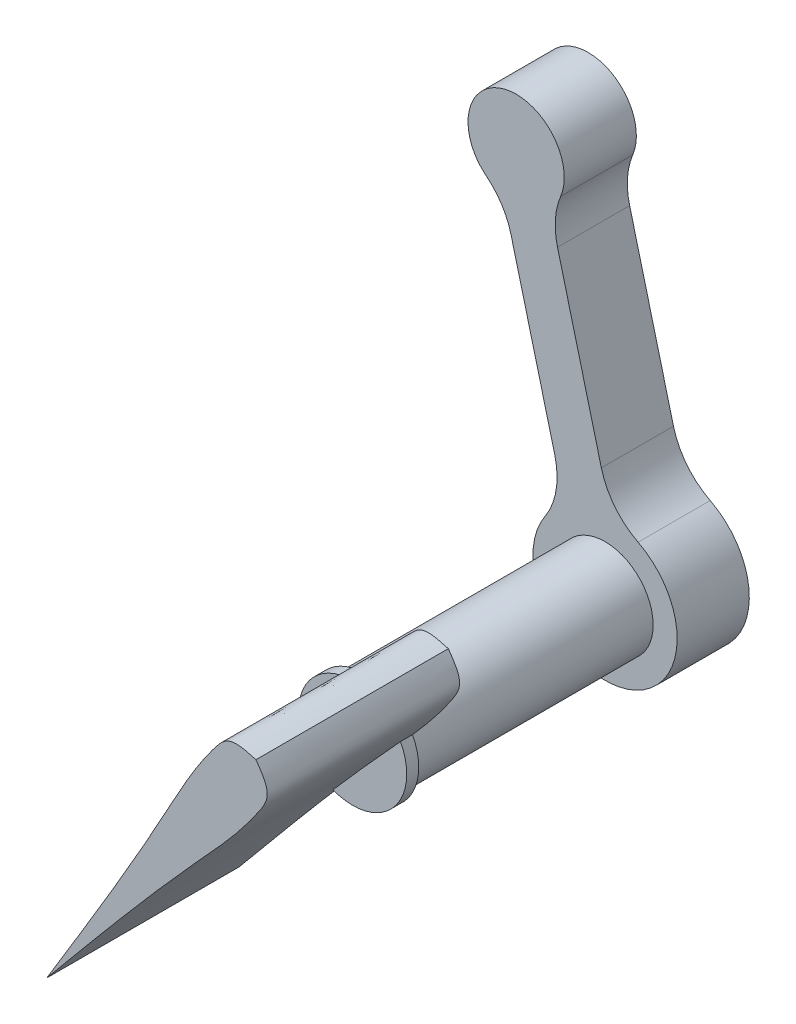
ISO-10303-21;
HEADER;
FILE_DESCRIPTION(('STEP AP214'),'2;1');
FILE_NAME('part.step','',(''),(''),'','','');
FILE_SCHEMA(('AUTOMOTIVE_DESIGN { 1 0 10303 214 1 1 1 1 }'));
ENDSEC;
DATA;
#1=APPLICATION_CONTEXT('core data for automotive mechanical design processes');
#2=APPLICATION_PROTOCOL_DEFINITION('international standard','automotive_design',2000,#1);
#3=PRODUCT_CONTEXT('',#1,'mechanical');
#4=PRODUCT('Part','Part','',(#3));
#5=PRODUCT_RELATED_PRODUCT_CATEGORY('part','',(#4));
#6=PRODUCT_DEFINITION_FORMATION('','',#4);
#7=PRODUCT_DEFINITION_CONTEXT('part definition',#1,'design');
#8=PRODUCT_DEFINITION('design','',#6,#7);
#9=PRODUCT_DEFINITION_SHAPE('','',#8);
#10=(LENGTH_UNIT() NAMED_UNIT(*) SI_UNIT(.MILLI.,.METRE.));
#11=(NAMED_UNIT(*) PLANE_ANGLE_UNIT() SI_UNIT($,.RADIAN.));
#12=(NAMED_UNIT(*) SI_UNIT($,.STERADIAN.) SOLID_ANGLE_UNIT());
#13=UNCERTAINTY_MEASURE_WITH_UNIT(LENGTH_MEASURE(1.E-05),#10,'distance_accuracy_value','');
#14=(GEOMETRIC_REPRESENTATION_CONTEXT(3) GLOBAL_UNCERTAINTY_ASSIGNED_CONTEXT((#13)) GLOBAL_UNIT_ASSIGNED_CONTEXT((#10,
#11,#12)) REPRESENTATION_CONTEXT('',''));
#15=CARTESIAN_POINT('',(0.,0.,0.));
#16=DIRECTION('',(0.,0.,1.));
#17=DIRECTION('',(1.,0.,0.));
#18=AXIS2_PLACEMENT_3D('',#15,#16,#17);
#19=CARTESIAN_POINT('',(-4.96243774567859,31.4097749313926,0.));
#20=DIRECTION('',(0.,0.,1.));
#21=DIRECTION('',(1.,0.,0.));
#22=AXIS2_PLACEMENT_3D('',#19,#20,#21);
#23=PLANE('',#22);
#24=CARTESIAN_POINT('',(-4.96243774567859,31.4097749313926,0.));
#25=DIRECTION('',(0.,0.,-1.));
#26=DIRECTION('',(1.,0.,0.));
#27=AXIS2_PLACEMENT_3D('',#24,#25,#26);
#28=CIRCLE('',#27,3.);
#29=CARTESIAN_POINT('',(-2.05836560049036,32.1623471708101,0.));
#30=VERTEX_POINT('',#29);
#31=CARTESIAN_POINT('',(-2.46545542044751,29.7469221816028,0.));
#32=VERTEX_POINT('',#31);
#33=EDGE_CURVE('E617',#30,#32,#28,.T.);
#34=ORIENTED_EDGE('',*,*,#33,.T.);
#35=CARTESIAN_POINT('',(0.0315269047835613,28.0840694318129,0.));
#36=DIRECTION('',(0.,0.,1.));
#37=DIRECTION('',(1.,0.,0.));
#38=AXIS2_PLACEMENT_3D('',#35,#36,#37);
#39=CIRCLE('',#38,3.);
#40=CARTESIAN_POINT('',(1.40664077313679,30.7503518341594,0.));
#41=VERTEX_POINT('',#40);
#42=EDGE_CURVE('E614',#32,#41,#39,.T.);
#43=ORIENTED_EDGE('',*,*,#42,.T.);
#44=CARTESIAN_POINT('',(2.78175464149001,33.4166342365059,0.));
#45=DIRECTION('',(0.,0.,-1.));
#46=DIRECTION('',(-1.,0.,0.));
#47=AXIS2_PLACEMENT_3D('',#44,#45,#46);
#48=CIRCLE('',#47,3.);
#49=CARTESIAN_POINT('',(-0.122317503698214,32.6640619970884,0.));
#50=VERTEX_POINT('',#49);
#51=EDGE_CURVE('E611',#41,#50,#48,.T.);
#52=ORIENTED_EDGE('',*,*,#51,.T.);
#53=DIRECTION('',(-0.250857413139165,0.968024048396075,0.));
#54=VECTOR('',#53,1.);
#55=CARTESIAN_POINT('',(-1.94552307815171,39.6995600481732,0.));
#56=LINE('',#55,#54);
#57=CARTESIAN_POINT('',(-1.94552307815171,39.6995600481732,0.));
#58=VERTEX_POINT('',#57);
#59=EDGE_CURVE('E608',#50,#58,#56,.T.);
#60=ORIENTED_EDGE('',*,*,#59,.T.);
#61=CARTESIAN_POINT('',(0.958549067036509,40.4521322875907,0.));
#62=DIRECTION('',(0.,0.,-1.));
#63=DIRECTION('',(-1.,0.,0.));
#64=AXIS2_PLACEMENT_3D('',#61,#62,#63);
#65=CIRCLE('',#64,3.);
#66=CARTESIAN_POINT('',(-1.81625199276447,41.5925177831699,0.));
#67=VERTEX_POINT('',#66);
#68=EDGE_CURVE('E605',#58,#67,#65,.T.);
#69=ORIENTED_EDGE('',*,*,#68,.T.);
#70=CARTESIAN_POINT('',(-3.66611936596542,42.3527747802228,0.));
#71=DIRECTION('',(0.,0.,1.));
#72=DIRECTION('',(1.,0.,0.));
#73=AXIS2_PLACEMENT_3D('',#70,#71,#72);
#74=CIRCLE('',#73,2.00000000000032);
#75=CARTESIAN_POINT('',(-4.91392894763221,40.7897740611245,0.));
#76=VERTEX_POINT('',#75);
#77=EDGE_CURVE('E602',#67,#76,#74,.T.);
#78=ORIENTED_EDGE('',*,*,#77,.T.);
#79=CARTESIAN_POINT('',(-6.78564332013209,38.4452729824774,0.));
#80=DIRECTION('',(0.,0.,-1.));
#81=DIRECTION('',(1.,0.,0.));
#82=AXIS2_PLACEMENT_3D('',#79,#80,#81);
#83=CIRCLE('',#82,3.);
#84=CARTESIAN_POINT('',(-3.88157117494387,39.1978452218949,0.));
#85=VERTEX_POINT('',#84);
#86=EDGE_CURVE('E599',#76,#85,#83,.T.);
#87=ORIENTED_EDGE('',*,*,#86,.T.);
#88=DIRECTION('',(0.250857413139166,-0.968024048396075,0.));
#89=VECTOR('',#88,1.);
#90=CARTESIAN_POINT('',(-3.88157117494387,39.1978452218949,0.));
#91=LINE('',#90,#89);
#92=EDGE_CURVE('E582',#85,#30,#91,.T.);
#93=ORIENTED_EDGE('',*,*,#92,.T.);
#94=EDGE_LOOP('',(#34,#43,#52,#60,#69,#78,#87,#93));
#95=FACE_BOUND('',#94,.T.);
#96=CARTESIAN_POINT('',(0.0315269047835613,28.0840694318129,0.));
#97=DIRECTION('',(0.,0.,1.));
#98=DIRECTION('',(1.,0.,0.));
#99=AXIS2_PLACEMENT_3D('',#96,#97,#98);
#100=CIRCLE('',#99,2.);
#101=CARTESIAN_POINT('',(2.03152690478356,28.0840694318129,0.));
#102=VERTEX_POINT('',#101);
#103=EDGE_CURVE('E633',#102,#102,#100,.T.);
#104=ORIENTED_EDGE('',*,*,#103,.F.);
#105=EDGE_LOOP('',(#104));
#106=FACE_BOUND('',#105,.T.);
#107=ADVANCED_FACE('F368',(#95,#106),#23,.T.);
#108=CARTESIAN_POINT('',(-4.96243774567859,31.4097749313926,-24.1407676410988));
#109=DIRECTION('',(0.,0.,1.));
#110=DIRECTION('',(1.,0.,0.));
#111=AXIS2_PLACEMENT_3D('',#108,#109,#110);
#112=CYLINDRICAL_SURFACE('',#111,3.);
#113=CARTESIAN_POINT('',(-4.96243774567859,31.4097749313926,-3.));
#114=DIRECTION('',(0.,0.,1.));
#115=DIRECTION('',(1.,0.,0.));
#116=AXIS2_PLACEMENT_3D('',#113,#114,#115);
#117=CIRCLE('',#116,3.);
#118=CARTESIAN_POINT('',(-2.46545542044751,29.7469221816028,-3.));
#119=VERTEX_POINT('',#118);
#120=CARTESIAN_POINT('',(-2.05836560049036,32.1623471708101,-3.));
#121=VERTEX_POINT('',#120);
#122=EDGE_CURVE('E569',#119,#121,#117,.T.);
#123=ORIENTED_EDGE('',*,*,#122,.F.);
#124=DIRECTION('',(0.,0.,1.));
#125=VECTOR('',#124,1.);
#126=CARTESIAN_POINT('',(-2.46545542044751,29.7469221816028,-24.1407676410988));
#127=LINE('',#126,#125);
#128=EDGE_CURVE('E566',#119,#32,#127,.T.);
#129=ORIENTED_EDGE('',*,*,#128,.T.);
#130=ORIENTED_EDGE('',*,*,#33,.F.);
#131=DIRECTION('',(0.,0.,1.));
#132=VECTOR('',#131,1.);
#133=CARTESIAN_POINT('',(-2.05836560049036,32.1623471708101,-24.1407676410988));
#134=LINE('',#133,#132);
#135=EDGE_CURVE('E594',#121,#30,#134,.T.);
#136=ORIENTED_EDGE('',*,*,#135,.F.);
#137=EDGE_LOOP('',(#123,#129,#130,#136));
#138=FACE_BOUND('',#137,.T.);
#139=ADVANCED_FACE('F370',(#138),#112,.F.);
#140=CARTESIAN_POINT('',(-3.88157117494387,39.1978452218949,-24.1407676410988));
#141=DIRECTION('',(-0.968024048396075,-0.250857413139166,0.));
#142=DIRECTION('',(0.250857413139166,-0.968024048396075,0.));
#143=AXIS2_PLACEMENT_3D('',#140,#141,#142);
#144=PLANE('',#143);
#145=DIRECTION('',(-0.250857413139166,0.968024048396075,0.));
#146=VECTOR('',#145,1.);
#147=CARTESIAN_POINT('',(-3.88157117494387,39.1978452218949,-3.));
#148=LINE('',#147,#146);
#149=CARTESIAN_POINT('',(-3.88157117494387,39.1978452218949,-3.));
#150=VERTEX_POINT('',#149);
#151=EDGE_CURVE('E573',#121,#150,#148,.T.);
#152=ORIENTED_EDGE('',*,*,#151,.F.);
#153=ORIENTED_EDGE('',*,*,#135,.T.);
#154=ORIENTED_EDGE('',*,*,#92,.F.);
#155=DIRECTION('',(0.,0.,1.));
#156=VECTOR('',#155,1.);
#157=CARTESIAN_POINT('',(-3.88157117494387,39.1978452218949,-24.1407676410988));
#158=LINE('',#157,#156);
#159=EDGE_CURVE('E592',#150,#85,#158,.T.);
#160=ORIENTED_EDGE('',*,*,#159,.F.);
#161=EDGE_LOOP('',(#152,#153,#154,#160));
#162=FACE_BOUND('',#161,.T.);
#163=ADVANCED_FACE('F532',(#162),#144,.T.);
#164=CARTESIAN_POINT('',(-6.78564332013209,38.4452729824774,-24.1407676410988));
#165=DIRECTION('',(0.,0.,1.));
#166=DIRECTION('',(1.,0.,0.));
#167=AXIS2_PLACEMENT_3D('',#164,#165,#166);
#168=CYLINDRICAL_SURFACE('',#167,3.);
#169=CARTESIAN_POINT('',(-6.78564332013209,38.4452729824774,-3.));
#170=DIRECTION('',(0.,0.,1.));
#171=DIRECTION('',(1.,0.,0.));
#172=AXIS2_PLACEMENT_3D('',#169,#170,#171);
#173=CIRCLE('',#172,3.);
#174=CARTESIAN_POINT('',(-4.9139289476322,40.7897740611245,-3.));
#175=VERTEX_POINT('',#174);
#176=EDGE_CURVE('E622',#150,#175,#173,.T.);
#177=ORIENTED_EDGE('',*,*,#176,.F.);
#178=ORIENTED_EDGE('',*,*,#159,.T.);
#179=ORIENTED_EDGE('',*,*,#86,.F.);
#180=DIRECTION('',(0.,0.,1.));
#181=VECTOR('',#180,1.);
#182=CARTESIAN_POINT('',(-4.91392894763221,40.7897740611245,-24.1407676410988));
#183=LINE('',#182,#181);
#184=EDGE_CURVE('E590',#175,#76,#183,.T.);
#185=ORIENTED_EDGE('',*,*,#184,.F.);
#186=EDGE_LOOP('',(#177,#178,#179,#185));
#187=FACE_BOUND('',#186,.T.);
#188=ADVANCED_FACE('F535',(#187),#168,.F.);
#189=CARTESIAN_POINT('',(-3.66611936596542,42.3527747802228,-24.1407676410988));
#190=DIRECTION('',(0.,0.,1.));
#191=DIRECTION('',(1.,0.,0.));
#192=AXIS2_PLACEMENT_3D('',#189,#190,#191);
#193=CYLINDRICAL_SURFACE('',#192,2.00000000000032);
#194=CARTESIAN_POINT('',(-3.66611936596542,42.3527747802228,-3.));
#195=DIRECTION('',(0.,0.,1.));
#196=DIRECTION('',(1.,0.,0.));
#197=AXIS2_PLACEMENT_3D('',#194,#195,#196);
#198=CIRCLE('',#197,2.00000000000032);
#199=CARTESIAN_POINT('',(-1.81625199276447,41.5925177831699,-3.));
#200=VERTEX_POINT('',#199);
#201=EDGE_CURVE('E624',#175,#200,#198,.F.);
#202=ORIENTED_EDGE('',*,*,#201,.F.);
#203=ORIENTED_EDGE('',*,*,#184,.T.);
#204=ORIENTED_EDGE('',*,*,#77,.F.);
#205=DIRECTION('',(0.,0.,1.));
#206=VECTOR('',#205,1.);
#207=CARTESIAN_POINT('',(-1.81625199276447,41.5925177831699,-24.1407676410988));
#208=LINE('',#207,#206);
#209=EDGE_CURVE('E588',#200,#67,#208,.T.);
#210=ORIENTED_EDGE('',*,*,#209,.F.);
#211=EDGE_LOOP('',(#202,#203,#204,#210));
#212=FACE_BOUND('',#211,.T.);
#213=ADVANCED_FACE('F539',(#212),#193,.T.);
#214=CARTESIAN_POINT('',(0.958549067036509,40.4521322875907,-24.1407676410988));
#215=DIRECTION('',(0.,0.,1.));
#216=DIRECTION('',(1.,0.,0.));
#217=AXIS2_PLACEMENT_3D('',#214,#215,#216);
#218=CYLINDRICAL_SURFACE('',#217,3.);
#219=CARTESIAN_POINT('',(0.958549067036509,40.4521322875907,-3.));
#220=DIRECTION('',(0.,0.,1.));
#221=DIRECTION('',(1.,0.,0.));
#222=AXIS2_PLACEMENT_3D('',#219,#220,#221);
#223=CIRCLE('',#222,3.);
#224=CARTESIAN_POINT('',(-1.94552307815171,39.6995600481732,-3.));
#225=VERTEX_POINT('',#224);
#226=EDGE_CURVE('E626',#200,#225,#223,.T.);
#227=ORIENTED_EDGE('',*,*,#226,.F.);
#228=ORIENTED_EDGE('',*,*,#209,.T.);
#229=ORIENTED_EDGE('',*,*,#68,.F.);
#230=DIRECTION('',(0.,0.,1.));
#231=VECTOR('',#230,1.);
#232=CARTESIAN_POINT('',(-1.94552307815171,39.6995600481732,-24.1407676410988));
#233=LINE('',#232,#231);
#234=EDGE_CURVE('E586',#225,#58,#233,.T.);
#235=ORIENTED_EDGE('',*,*,#234,.F.);
#236=EDGE_LOOP('',(#227,#228,#229,#235));
#237=FACE_BOUND('',#236,.T.);
#238=ADVANCED_FACE('F543',(#237),#218,.F.);
#239=CARTESIAN_POINT('',(-1.94552307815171,39.6995600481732,-24.1407676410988));
#240=DIRECTION('',(0.968024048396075,0.250857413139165,0.));
#241=DIRECTION('',(-0.250857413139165,0.968024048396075,0.));
#242=AXIS2_PLACEMENT_3D('',#239,#240,#241);
#243=PLANE('',#242);
#244=DIRECTION('',(0.250857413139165,-0.968024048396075,0.));
#245=VECTOR('',#244,1.);
#246=CARTESIAN_POINT('',(-1.94552307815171,39.6995600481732,-3.));
#247=LINE('',#246,#245);
#248=CARTESIAN_POINT('',(-0.122317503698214,32.6640619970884,-3.));
#249=VERTEX_POINT('',#248);
#250=EDGE_CURVE('E628',#225,#249,#247,.T.);
#251=ORIENTED_EDGE('',*,*,#250,.F.);
#252=ORIENTED_EDGE('',*,*,#234,.T.);
#253=ORIENTED_EDGE('',*,*,#59,.F.);
#254=DIRECTION('',(0.,0.,1.));
#255=VECTOR('',#254,1.);
#256=CARTESIAN_POINT('',(-0.122317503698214,32.6640619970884,-24.1407676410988));
#257=LINE('',#256,#255);
#258=EDGE_CURVE('E584',#249,#50,#257,.T.);
#259=ORIENTED_EDGE('',*,*,#258,.F.);
#260=EDGE_LOOP('',(#251,#252,#253,#259));
#261=FACE_BOUND('',#260,.T.);
#262=ADVANCED_FACE('F547',(#261),#243,.T.);
#263=CARTESIAN_POINT('',(2.78175464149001,33.4166342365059,-24.1407676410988));
#264=DIRECTION('',(0.,0.,1.));
#265=DIRECTION('',(1.,0.,0.));
#266=AXIS2_PLACEMENT_3D('',#263,#264,#265);
#267=CYLINDRICAL_SURFACE('',#266,3.);
#268=CARTESIAN_POINT('',(2.78175464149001,33.4166342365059,-3.));
#269=DIRECTION('',(0.,0.,1.));
#270=DIRECTION('',(1.,0.,0.));
#271=AXIS2_PLACEMENT_3D('',#268,#269,#270);
#272=CIRCLE('',#271,3.);
#273=CARTESIAN_POINT('',(1.40664077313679,30.7503518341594,-3.));
#274=VERTEX_POINT('',#273);
#275=EDGE_CURVE('E596',#249,#274,#272,.T.);
#276=ORIENTED_EDGE('',*,*,#275,.F.);
#277=ORIENTED_EDGE('',*,*,#258,.T.);
#278=ORIENTED_EDGE('',*,*,#51,.F.);
#279=DIRECTION('',(0.,0.,1.));
#280=VECTOR('',#279,1.);
#281=CARTESIAN_POINT('',(1.40664077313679,30.7503518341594,-24.1407676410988));
#282=LINE('',#281,#280);
#283=EDGE_CURVE('E564',#274,#41,#282,.T.);
#284=ORIENTED_EDGE('',*,*,#283,.F.);
#285=EDGE_LOOP('',(#276,#277,#278,#284));
#286=FACE_BOUND('',#285,.T.);
#287=ADVANCED_FACE('F551',(#286),#267,.F.);
#288=CARTESIAN_POINT('',(0.0315269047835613,28.0840694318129,-24.1407676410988));
#289=DIRECTION('',(0.,0.,1.));
#290=DIRECTION('',(1.,0.,0.));
#291=AXIS2_PLACEMENT_3D('',#288,#289,#290);
#292=CYLINDRICAL_SURFACE('',#291,3.);
#293=CARTESIAN_POINT('',(0.0315269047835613,28.0840694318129,-3.));
#294=DIRECTION('',(0.,0.,1.));
#295=DIRECTION('',(1.,0.,0.));
#296=AXIS2_PLACEMENT_3D('',#293,#294,#295);
#297=CIRCLE('',#296,3.);
#298=EDGE_CURVE('E561',#274,#119,#297,.F.);
#299=ORIENTED_EDGE('',*,*,#298,.F.);
#300=ORIENTED_EDGE('',*,*,#283,.T.);
#301=ORIENTED_EDGE('',*,*,#42,.F.);
#302=ORIENTED_EDGE('',*,*,#128,.F.);
#303=EDGE_LOOP('',(#299,#300,#301,#302));
#304=FACE_BOUND('',#303,.T.);
#305=ADVANCED_FACE('F527',(#304),#292,.T.);
#306=CARTESIAN_POINT('',(-12.9908873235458,16.8236838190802,-3.));
#307=DIRECTION('',(0.,0.,1.));
#308=DIRECTION('',(1.,0.,0.));
#309=AXIS2_PLACEMENT_3D('',#306,#307,#308);
#310=PLANE('',#309);
#311=ORIENTED_EDGE('',*,*,#122,.T.);
#312=ORIENTED_EDGE('',*,*,#151,.T.);
#313=ORIENTED_EDGE('',*,*,#176,.T.);
#314=ORIENTED_EDGE('',*,*,#201,.T.);
#315=ORIENTED_EDGE('',*,*,#226,.T.);
#316=ORIENTED_EDGE('',*,*,#250,.T.);
#317=ORIENTED_EDGE('',*,*,#275,.T.);
#318=ORIENTED_EDGE('',*,*,#298,.T.);
#319=EDGE_LOOP('',(#311,#312,#313,#314,#315,#316,#317,#318));
#320=FACE_BOUND('',#319,.T.);
#321=ADVANCED_FACE('F523',(#320),#310,.F.);
#322=CARTESIAN_POINT('',(0.0315269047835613,28.0840694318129,15.6568542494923));
#323=DIRECTION('',(0.,0.,-1.));
#324=DIRECTION('',(-1.,0.,0.));
#325=AXIS2_PLACEMENT_3D('',#322,#323,#324);
#326=CYLINDRICAL_SURFACE('',#325,2.);
#327=CARTESIAN_POINT('',(0.0315269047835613,28.0840694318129,9.99999999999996));
#328=DIRECTION('',(0.,0.,-1.));
#329=DIRECTION('',(-1.,0.,0.));
#330=AXIS2_PLACEMENT_3D('',#327,#328,#329);
#331=CIRCLE('',#330,2.);
#332=CARTESIAN_POINT('',(-1.96847309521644,28.0840694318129,9.99999999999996));
#333=VERTEX_POINT('',#332);
#334=EDGE_CURVE('E619',#333,#333,#331,.T.);
#335=ORIENTED_EDGE('',*,*,#334,.T.);
#336=EDGE_LOOP('',(#335));
#337=FACE_BOUND('',#336,.T.);
#338=ORIENTED_EDGE('',*,*,#103,.T.);
#339=EDGE_LOOP('',(#338));
#340=FACE_BOUND('',#339,.T.);
#341=ADVANCED_FACE('F520',(#337,#340),#326,.T.);
#342=CARTESIAN_POINT('',(-0.124097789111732,26.7433784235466,9.99999999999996));
#343=DIRECTION('',(0.,0.,1.));
#344=DIRECTION('',(1.,0.,0.));
#345=AXIS2_PLACEMENT_3D('',#342,#343,#344);
#346=PLANE('',#345);
#347=CARTESIAN_POINT('',(-5.19118575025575,20.7544533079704,9.99999999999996));
#348=CARTESIAN_POINT('',(-3.11700723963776,23.2556023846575,9.99999999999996));
#349=CARTESIAN_POINT('',(-0.17953774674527,26.7977512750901,9.99999999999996));
#350=CARTESIAN_POINT('',(3.0193909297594,30.1718916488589,9.99999999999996));
#351=CARTESIAN_POINT('',(4.18448649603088,32.0101470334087,9.99999999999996));
#352=CARTESIAN_POINT('',(3.76209884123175,32.6145308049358,9.99999999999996));
#353=CARTESIAN_POINT('',(3.51333534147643,32.9704801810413,9.99999999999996));
#354=B_SPLINE_CURVE_WITH_KNOTS('',3,(#347,#348,#349,#350,#351,#352,#353),.UNSPECIFIED.,.F.,.F.,
(4,1,1,1,4),(0.,0.616648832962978,0.873303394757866,0.925382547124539,1.),.UNSPECIFIED.);
#355=CARTESIAN_POINT('',(2.02444413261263,29.1284740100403,9.99999999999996));
#356=VERTEX_POINT('',#355);
#357=CARTESIAN_POINT('',(3.51333534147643,32.9704801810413,9.99999999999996));
#358=VERTEX_POINT('',#357);
#359=EDGE_CURVE('E466',#356,#358,#354,.T.);
#360=ORIENTED_EDGE('',*,*,#359,.F.);
#361=CARTESIAN_POINT('',(0.0315269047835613,28.0840694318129,9.99999999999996));
#362=DIRECTION('',(0.,0.,-1.));
#363=DIRECTION('',(-1.,0.,0.));
#364=AXIS2_PLACEMENT_3D('',#361,#362,#363);
#365=CIRCLE('',#364,2.25);
#366=CARTESIAN_POINT('',(-0.785156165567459,25.9875177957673,9.99999999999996));
#367=VERTEX_POINT('',#366);
#368=EDGE_CURVE('E661',#356,#367,#365,.T.);
#369=ORIENTED_EDGE('',*,*,#368,.T.);
#370=CARTESIAN_POINT('',(-5.19118575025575,20.7544533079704,9.99999999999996));
#371=VERTEX_POINT('',#370);
#372=EDGE_CURVE('E477',#371,#367,#354,.T.);
#373=ORIENTED_EDGE('',*,*,#372,.F.);
#374=CARTESIAN_POINT('',(3.51333534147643,32.9704801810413,9.99999999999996));
#375=CARTESIAN_POINT('',(3.09567163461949,33.0893930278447,9.99999999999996));
#376=CARTESIAN_POINT('',(2.38650009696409,33.2913009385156,9.99999999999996));
#377=CARTESIAN_POINT('',(1.02939095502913,31.589864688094,9.99999999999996));
#378=CARTESIAN_POINT('',(-1.11538444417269,27.4645881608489,9.99999999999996));
#379=CARTESIAN_POINT('',(-3.50432755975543,23.5315871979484,9.99999999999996));
#380=CARTESIAN_POINT('',(-5.19118575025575,20.7544533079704,9.99999999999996));
#381=B_SPLINE_CURVE_WITH_KNOTS('',3,(#374,#375,#376,#377,#378,#379,#380),.UNSPECIFIED.,.F.,.F.,
(4,1,1,1,4),(0.,0.0746174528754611,0.126696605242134,0.383351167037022,1.),.UNSPECIFIED.);
#382=CARTESIAN_POINT('',(-1.68347995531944,26.6276177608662,9.99999999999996));
#383=VERTEX_POINT('',#382);
#384=EDGE_CURVE('E491',#383,#371,#381,.T.);
#385=ORIENTED_EDGE('',*,*,#384,.F.);
#386=CARTESIAN_POINT('',(0.368006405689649,30.308767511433,9.99999999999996));
#387=VERTEX_POINT('',#386);
#388=EDGE_CURVE('E490',#383,#387,#365,.T.);
#389=ORIENTED_EDGE('',*,*,#388,.T.);
#390=EDGE_CURVE('E480',#358,#387,#381,.T.);
#391=ORIENTED_EDGE('',*,*,#390,.F.);
#392=EDGE_LOOP('',(#360,#369,#373,#385,#389,#391));
#393=FACE_BOUND('',#392,.T.);
#394=ORIENTED_EDGE('',*,*,#334,.F.);
#395=EDGE_LOOP('',(#394));
#396=FACE_BOUND('',#395,.T.);
#397=ADVANCED_FACE('F486',(#393,#396),#346,.F.);
#398=CARTESIAN_POINT('',(3.51333534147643,32.9704801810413,33.6548963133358));
#399=CARTESIAN_POINT('',(3.09567163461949,33.0893930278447,33.6548963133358));
#400=CARTESIAN_POINT('',(2.38650009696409,33.2913009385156,33.6548963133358));
#401=CARTESIAN_POINT('',(1.02939095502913,31.589864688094,33.6548963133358));
#402=CARTESIAN_POINT('',(-1.11538444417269,27.4645881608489,33.6548963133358));
#403=CARTESIAN_POINT('',(-3.50432755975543,23.5315871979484,33.6548963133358));
#404=CARTESIAN_POINT('',(-5.19118575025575,20.7544533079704,33.6548963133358));
#405=B_SPLINE_CURVE_WITH_KNOTS('',3,(#398,#399,#400,#401,#402,#403,#404),.UNSPECIFIED.,.F.,.F.,
(4,1,1,1,4),(0.,0.0746174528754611,0.126696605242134,0.383351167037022,1.),.UNSPECIFIED.);
#406=DIRECTION('',(0.,0.,-1.));
#407=VECTOR('',#406,1.);
#408=SURFACE_OF_LINEAR_EXTRUSION('',#405,#407);
#409=ORIENTED_EDGE('',*,*,#390,.T.);
#410=DIRECTION('',(0.,0.,-1.));
#411=VECTOR('',#410,1.);
#412=CARTESIAN_POINT('',(0.36800640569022,30.308767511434,14.));
#413=LINE('',#412,#411);
#414=CARTESIAN_POINT('',(0.368006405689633,30.3087675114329,10.5));
#415=VERTEX_POINT('',#414);
#416=EDGE_CURVE('E383',#387,#415,#413,.F.);
#417=ORIENTED_EDGE('',*,*,#416,.T.);
#418=CARTESIAN_POINT('',(3.51333534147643,32.9704801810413,10.5));
#419=CARTESIAN_POINT('',(3.09567163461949,33.0893930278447,10.5));
#420=CARTESIAN_POINT('',(2.38650009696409,33.2913009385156,10.5));
#421=CARTESIAN_POINT('',(1.02939095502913,31.589864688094,10.5));
#422=CARTESIAN_POINT('',(-1.11538444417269,27.4645881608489,10.5));
#423=CARTESIAN_POINT('',(-3.50432755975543,23.5315871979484,10.5));
#424=CARTESIAN_POINT('',(-5.19118575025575,20.7544533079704,10.5));
#425=B_SPLINE_CURVE_WITH_KNOTS('',3,(#418,#419,#420,#421,#422,#423,#424),.UNSPECIFIED.,.F.,.F.,
(4,1,1,1,4),(0.,0.0746174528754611,0.126696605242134,0.383351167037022,1.),.UNSPECIFIED.);
#426=CARTESIAN_POINT('',(-1.683479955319,26.627617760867,10.5));
#427=VERTEX_POINT('',#426);
#428=EDGE_CURVE('E387',#427,#415,#425,.F.);
#429=ORIENTED_EDGE('',*,*,#428,.F.);
#430=DIRECTION('',(0.,0.,-1.));
#431=VECTOR('',#430,1.);
#432=CARTESIAN_POINT('',(-1.68347995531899,26.627617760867,14.));
#433=LINE('',#432,#431);
#434=EDGE_CURVE('E649',#427,#383,#433,.T.);
#435=ORIENTED_EDGE('',*,*,#434,.T.);
#436=ORIENTED_EDGE('',*,*,#384,.T.);
#437=DIRECTION('',(0.,0.,-1.));
#438=VECTOR('',#437,1.);
#439=CARTESIAN_POINT('',(-5.19118575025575,20.7544533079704,33.6548963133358));
#440=LINE('',#439,#438);
#441=CARTESIAN_POINT('',(-5.19118575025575,20.7544533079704,18.));
#442=VERTEX_POINT('',#441);
#443=EDGE_CURVE('E483',#442,#371,#440,.T.);
#444=ORIENTED_EDGE('',*,*,#443,.F.);
#445=CARTESIAN_POINT('',(3.51333534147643,32.9704801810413,18.));
#446=CARTESIAN_POINT('',(3.09567163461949,33.0893930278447,18.));
#447=CARTESIAN_POINT('',(2.38650009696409,33.2913009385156,18.));
#448=CARTESIAN_POINT('',(1.02939095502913,31.589864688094,18.));
#449=CARTESIAN_POINT('',(-1.11538444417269,27.4645881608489,18.));
#450=CARTESIAN_POINT('',(-3.50432755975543,23.5315871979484,18.));
#451=CARTESIAN_POINT('',(-5.19118575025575,20.7544533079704,18.));
#452=B_SPLINE_CURVE_WITH_KNOTS('',3,(#445,#446,#447,#448,#449,#450,#451),.UNSPECIFIED.,.F.,.F.,
(4,1,1,1,4),(0.,0.0746174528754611,0.126696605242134,0.383351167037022,1.),.UNSPECIFIED.);
#453=CARTESIAN_POINT('',(3.51333534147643,32.9704801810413,18.));
#454=VERTEX_POINT('',#453);
#455=EDGE_CURVE('E482',#442,#454,#452,.F.);
#456=ORIENTED_EDGE('',*,*,#455,.T.);
#457=DIRECTION('',(0.,0.,-1.));
#458=VECTOR('',#457,1.);
#459=CARTESIAN_POINT('',(3.51333534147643,32.9704801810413,33.6548963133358));
#460=LINE('',#459,#458);
#461=EDGE_CURVE('E470',#454,#358,#460,.T.);
#462=ORIENTED_EDGE('',*,*,#461,.T.);
#463=EDGE_LOOP('',(#409,#417,#429,#435,#436,#444,#456,#462));
#464=FACE_BOUND('',#463,.T.);
#465=ADVANCED_FACE('F479',(#464),#408,.F.);
#466=CARTESIAN_POINT('',(-5.19118575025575,20.7544533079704,33.6548963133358));
#467=CARTESIAN_POINT('',(-3.11700723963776,23.2556023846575,33.6548963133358));
#468=CARTESIAN_POINT('',(-0.17953774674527,26.7977512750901,33.6548963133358));
#469=CARTESIAN_POINT('',(3.0193909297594,30.1718916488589,33.6548963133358));
#470=CARTESIAN_POINT('',(4.18448649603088,32.0101470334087,33.6548963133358));
#471=CARTESIAN_POINT('',(3.76209884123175,32.6145308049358,33.6548963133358));
#472=CARTESIAN_POINT('',(3.51333534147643,32.9704801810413,33.6548963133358));
#473=B_SPLINE_CURVE_WITH_KNOTS('',3,(#466,#467,#468,#469,#470,#471,#472),.UNSPECIFIED.,.F.,.F.,
(4,1,1,1,4),(0.,0.616648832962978,0.873303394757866,0.925382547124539,1.),.UNSPECIFIED.);
#474=DIRECTION('',(0.,0.,-1.));
#475=VECTOR('',#474,1.);
#476=SURFACE_OF_LINEAR_EXTRUSION('',#473,#475);
#477=ORIENTED_EDGE('',*,*,#372,.T.);
#478=DIRECTION('',(0.,0.,-1.));
#479=VECTOR('',#478,1.);
#480=CARTESIAN_POINT('',(-0.785156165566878,25.9875177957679,14.));
#481=LINE('',#480,#479);
#482=CARTESIAN_POINT('',(-0.785156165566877,25.9875177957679,10.5));
#483=VERTEX_POINT('',#482);
#484=EDGE_CURVE('E11',#367,#483,#481,.F.);
#485=ORIENTED_EDGE('',*,*,#484,.T.);
#486=CARTESIAN_POINT('',(-5.19118575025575,20.7544533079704,10.5));
#487=CARTESIAN_POINT('',(-3.11700723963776,23.2556023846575,10.5));
#488=CARTESIAN_POINT('',(-0.17953774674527,26.7977512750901,10.5));
#489=CARTESIAN_POINT('',(3.0193909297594,30.1718916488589,10.5));
#490=CARTESIAN_POINT('',(4.18448649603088,32.0101470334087,10.5));
#491=CARTESIAN_POINT('',(3.76209884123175,32.6145308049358,10.5));
#492=CARTESIAN_POINT('',(3.51333534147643,32.9704801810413,10.5));
#493=B_SPLINE_CURVE_WITH_KNOTS('',3,(#486,#487,#488,#489,#490,#491,#492),.UNSPECIFIED.,.F.,.F.,
(4,1,1,1,4),(0.,0.616648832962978,0.873303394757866,0.925382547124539,1.),.UNSPECIFIED.);
#494=CARTESIAN_POINT('',(2.02444413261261,29.1284740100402,10.5));
#495=VERTEX_POINT('',#494);
#496=EDGE_CURVE('E568',#495,#483,#493,.F.);
#497=ORIENTED_EDGE('',*,*,#496,.F.);
#498=DIRECTION('',(0.,0.,-1.));
#499=VECTOR('',#498,1.);
#500=CARTESIAN_POINT('',(2.02444413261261,29.1284740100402,14.));
#501=LINE('',#500,#499);
#502=EDGE_CURVE('E376',#495,#356,#501,.T.);
#503=ORIENTED_EDGE('',*,*,#502,.T.);
#504=ORIENTED_EDGE('',*,*,#359,.T.);
#505=ORIENTED_EDGE('',*,*,#461,.F.);
#506=CARTESIAN_POINT('',(-5.19118575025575,20.7544533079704,18.));
#507=CARTESIAN_POINT('',(-3.11700723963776,23.2556023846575,18.));
#508=CARTESIAN_POINT('',(-0.17953774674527,26.7977512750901,18.));
#509=CARTESIAN_POINT('',(3.0193909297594,30.1718916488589,18.));
#510=CARTESIAN_POINT('',(4.18448649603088,32.0101470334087,18.));
#511=CARTESIAN_POINT('',(3.76209884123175,32.6145308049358,18.));
#512=CARTESIAN_POINT('',(3.51333534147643,32.9704801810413,18.));
#513=B_SPLINE_CURVE_WITH_KNOTS('',3,(#506,#507,#508,#509,#510,#511,#512),.UNSPECIFIED.,.F.,.F.,
(4,1,1,1,4),(0.,0.616648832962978,0.873303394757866,0.925382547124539,1.),.UNSPECIFIED.);
#514=EDGE_CURVE('E636',#454,#442,#513,.F.);
#515=ORIENTED_EDGE('',*,*,#514,.T.);
#516=ORIENTED_EDGE('',*,*,#443,.T.);
#517=EDGE_LOOP('',(#477,#485,#497,#503,#504,#505,#515,#516));
#518=FACE_BOUND('',#517,.T.);
#519=ADVANCED_FACE('F468',(#518),#476,.F.);
#520=CARTESIAN_POINT('',(0.,20.,18.));
#521=DIRECTION('',(0.,0.,-1.));
#522=DIRECTION('',(-1.,0.,0.));
#523=AXIS2_PLACEMENT_3D('',#520,#521,#522);
#524=PLANE('',#523);
#525=ORIENTED_EDGE('',*,*,#455,.F.);
#526=ORIENTED_EDGE('',*,*,#514,.F.);
#527=EDGE_LOOP('',(#525,#526));
#528=FACE_BOUND('',#527,.T.);
#529=ADVANCED_FACE('F518',(#528),#524,.F.);
#530=CARTESIAN_POINT('',(0.0315269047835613,28.0840694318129,10.5));
#531=DIRECTION('',(0.,0.,-1.));
#532=DIRECTION('',(-1.,0.,0.));
#533=AXIS2_PLACEMENT_3D('',#530,#531,#532);
#534=PLANE('',#533);
#535=CARTESIAN_POINT('',(0.0315269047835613,28.0840694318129,10.5));
#536=DIRECTION('',(0.,0.,-1.));
#537=DIRECTION('',(-1.,0.,0.));
#538=AXIS2_PLACEMENT_3D('',#535,#536,#537);
#539=CIRCLE('',#538,2.25);
#540=EDGE_CURVE('E654',#495,#483,#539,.T.);
#541=ORIENTED_EDGE('',*,*,#540,.F.);
#542=ORIENTED_EDGE('',*,*,#496,.T.);
#543=EDGE_LOOP('',(#541,#542));
#544=FACE_BOUND('',#543,.T.);
#545=ADVANCED_FACE('F669',(#544),#534,.F.);
#546=CARTESIAN_POINT('',(0.0315269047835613,28.0840694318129,10.5));
#547=DIRECTION('',(0.,0.,-1.));
#548=DIRECTION('',(-1.,0.,0.));
#549=AXIS2_PLACEMENT_3D('',#546,#547,#548);
#550=CYLINDRICAL_SURFACE('',#549,2.25);
#551=ORIENTED_EDGE('',*,*,#484,.F.);
#552=ORIENTED_EDGE('',*,*,#368,.F.);
#553=ORIENTED_EDGE('',*,*,#502,.F.);
#554=ORIENTED_EDGE('',*,*,#540,.T.);
#555=EDGE_LOOP('',(#551,#552,#553,#554));
#556=FACE_BOUND('',#555,.T.);
#557=ADVANCED_FACE('F665',(#556),#550,.T.);
#558=ORIENTED_EDGE('',*,*,#416,.F.);
#559=ORIENTED_EDGE('',*,*,#388,.F.);
#560=ORIENTED_EDGE('',*,*,#434,.F.);
#561=EDGE_CURVE('E655',#427,#415,#539,.T.);
#562=ORIENTED_EDGE('',*,*,#561,.T.);
#563=EDGE_LOOP('',(#558,#559,#560,#562));
#564=FACE_BOUND('',#563,.T.);
#565=ADVANCED_FACE('F676',(#564),#550,.T.);
#566=ORIENTED_EDGE('',*,*,#561,.F.);
#567=ORIENTED_EDGE('',*,*,#428,.T.);
#568=EDGE_LOOP('',(#566,#567));
#569=FACE_BOUND('',#568,.T.);
#570=ADVANCED_FACE('F672',(#569),#534,.F.);
#571=CLOSED_SHELL('',(#107,#139,#163,#188,#213,#238,#262,#287,#305,#321,#341,#397,#465,#519,
#529,#545,#557,#565,#570));
#572=MANIFOLD_SOLID_BREP('B2',#571);
#573=ADVANCED_BREP_SHAPE_REPRESENTATION('',(#18,#572),#14);
#574=SHAPE_DEFINITION_REPRESENTATION(#9,#573);
ENDSEC;
END-ISO-10303-21;
